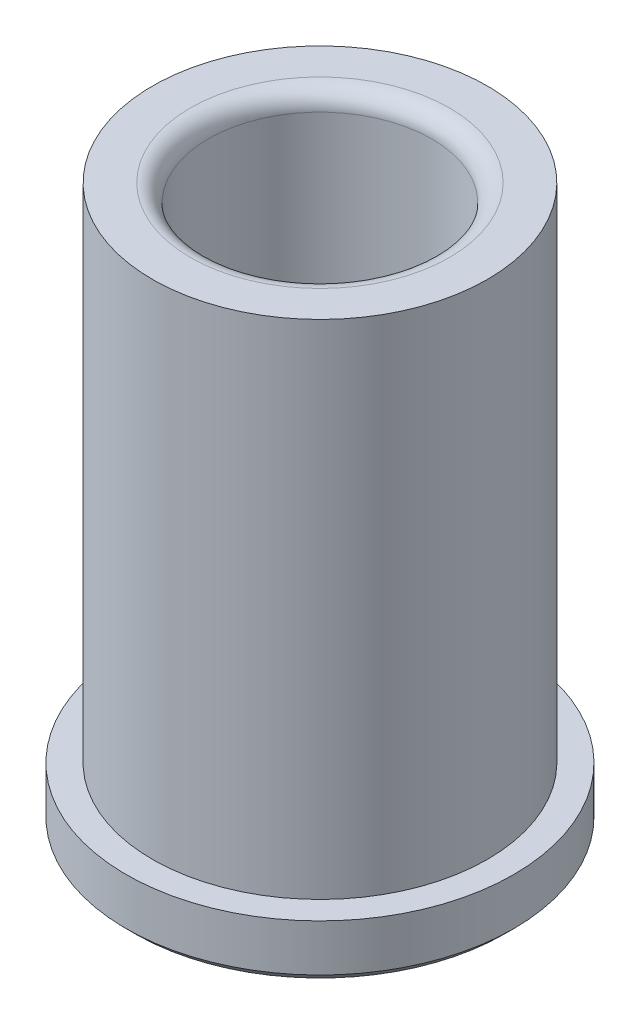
from build123d import *

# Parameters (mm, degrees)
FILLET1_R = 1.524


with BuildPart() as part:
    # Sketch1 → Revolve1 (revolve)
    with BuildSketch(Plane.XY, mode=Mode.PRIVATE) as revolve1_sk:
        Polygon((-15.7734, 0), (-16.5354, 0.762), (-16.5354, 4.7625), (-14.29385, 4.7625), (-14.29385, 47.625), (-9.53135, 47.625), (-9.53135, 0.762), (-10.29335, 0), align=None)
    revolve(revolve1_sk.sketch.rotate(Axis((0, -1000, 0), (0, 1, 0)), 180), axis=Axis((0, -1000, 0), (0, 1, 0)))

    # Fillet1
    fillet1_edges = [part.edges().sort_by_distance(p)[0] for p in [
        (-9.53135, 47.625, 0),
    ]]
    fillet(fillet1_edges, radius=FILLET1_R)


solid = part.part
